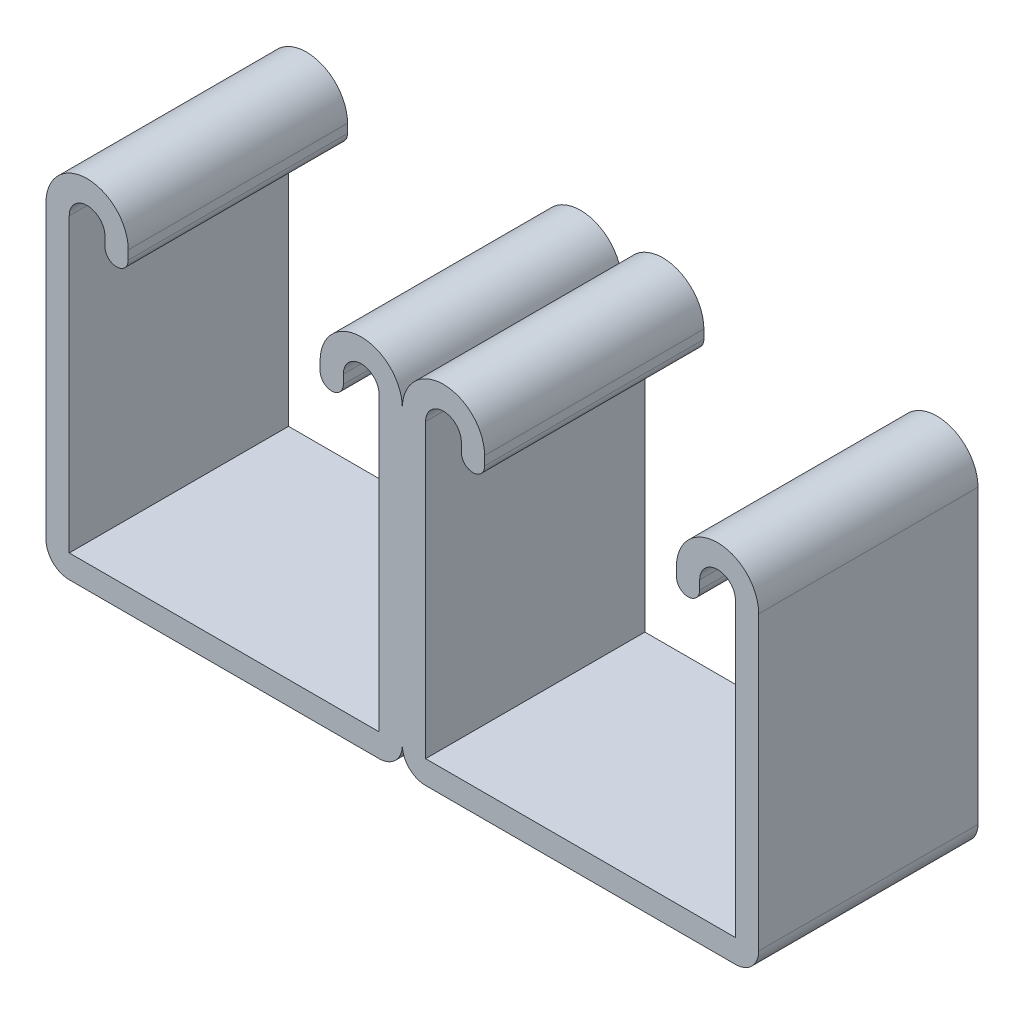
from build123d import *

# Parameters (mm, degrees)
BASE_EXTRUDE_DEPTH = 12.7
LPATTERN1_COUNT    = 2
LPATTERN1_PITCH    = 41.275


with BuildPart() as part:
    # Sketch1 → Base-Extrude (new, symmetric)
    with BuildSketch(Plane.XY):
        with BuildLine():
            Line((-41.275, 18.4785), (-41.275, -15.3416))
            ThreePointArc((-41.275, -15.3416), (-40.486414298, -17.245414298), (-38.5826, -18.034))
            Line((-38.5826, -18.034), (-2.6924, -18.034))
            ThreePointArc((-2.6924, -18.034), (-0.788585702, -17.245414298), (0, -15.3416))
            Line((0, -15.3416), (0, 18.4785))
            ThreePointArc((0, 18.4785), (-4.7625, 23.241), (-9.525, 18.4785))
            Line((-9.525, 18.4785), (-9.525, 17.44345))
            ThreePointArc((-9.525, 17.44345), (-8.1788, 16.09725), (-6.8326, 17.44345))
            Line((-6.8326, 17.44345), (-6.8326, 18.4785))
            ThreePointArc((-6.8326, 18.4785), (-4.7625, 20.5486), (-2.6924, 18.4785))
            Line((-2.6924, 18.4785), (-2.6924, -15.3416))
            Line((-2.6924, -15.3416), (-38.5826, -15.3416))
            Line((-38.5826, -15.3416), (-38.5826, 18.4785))
            ThreePointArc((-38.5826, 18.4785), (-36.5125, 20.5486), (-34.4424, 18.4785))
            Line((-34.4424, 18.4785), (-34.4424, 17.44345))
            ThreePointArc((-34.4424, 17.44345), (-33.0962, 16.09725), (-31.75, 17.44345))
            Line((-31.75, 17.44345), (-31.75, 18.4785))
            ThreePointArc((-31.75, 18.4785), (-36.5125, 23.241), (-41.275, 18.4785))
        make_face()
    base_extrude = extrude(amount=BASE_EXTRUDE_DEPTH, both=True)

    # LPattern1: Base-Extrude ×2
    with Locations(*[(i * LPATTERN1_PITCH, 0, 0) for i in range(1, LPATTERN1_COUNT)]):
        add(base_extrude)


solid = part.part
